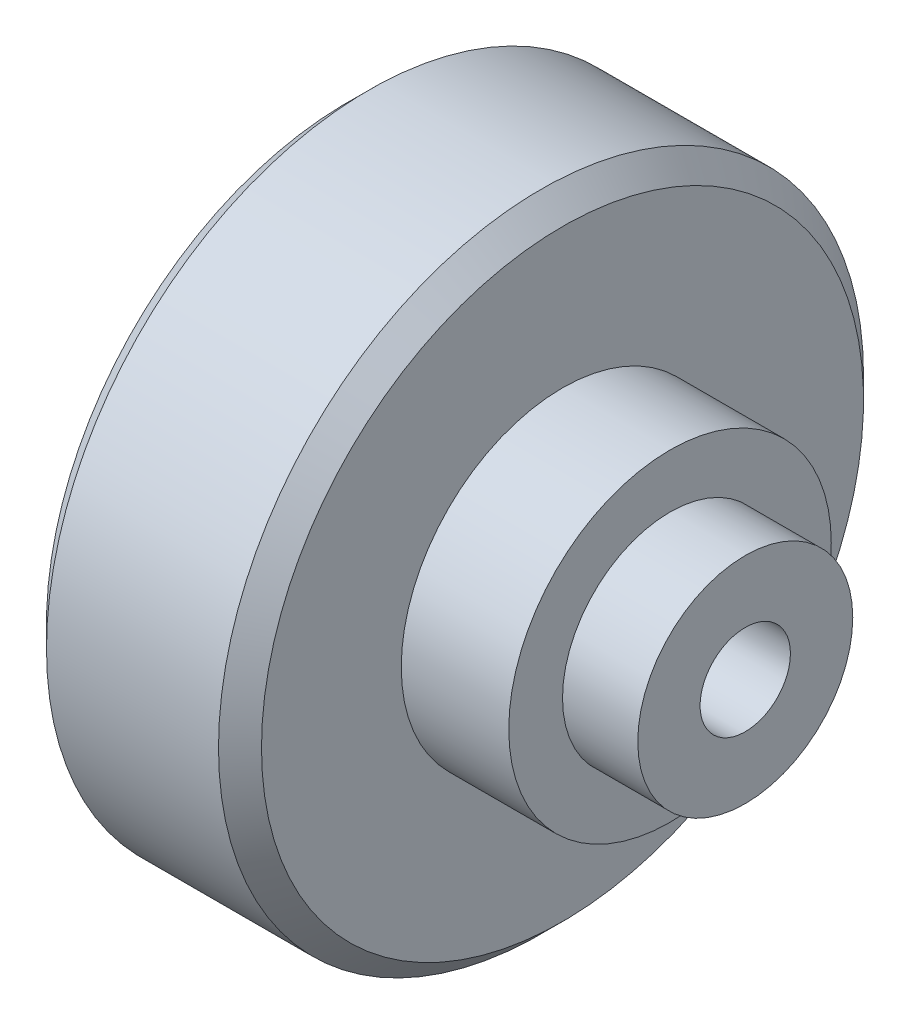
ISO-10303-21;
HEADER;
FILE_DESCRIPTION(('STEP AP214'),'2;1');
FILE_NAME('part.step','',(''),(''),'','','');
FILE_SCHEMA(('AUTOMOTIVE_DESIGN { 1 0 10303 214 1 1 1 1 }'));
ENDSEC;
DATA;
#1=APPLICATION_CONTEXT('core data for automotive mechanical design processes');
#2=APPLICATION_PROTOCOL_DEFINITION('international standard','automotive_design',2000,#1);
#3=PRODUCT_CONTEXT('',#1,'mechanical');
#4=PRODUCT('Part','Part','',(#3));
#5=PRODUCT_RELATED_PRODUCT_CATEGORY('part','',(#4));
#6=PRODUCT_DEFINITION_FORMATION('','',#4);
#7=PRODUCT_DEFINITION_CONTEXT('part definition',#1,'design');
#8=PRODUCT_DEFINITION('design','',#6,#7);
#9=PRODUCT_DEFINITION_SHAPE('','',#8);
#10=(LENGTH_UNIT() NAMED_UNIT(*) SI_UNIT(.MILLI.,.METRE.));
#11=(NAMED_UNIT(*) PLANE_ANGLE_UNIT() SI_UNIT($,.RADIAN.));
#12=(NAMED_UNIT(*) SI_UNIT($,.STERADIAN.) SOLID_ANGLE_UNIT());
#13=UNCERTAINTY_MEASURE_WITH_UNIT(LENGTH_MEASURE(1.E-05),#10,'distance_accuracy_value','');
#14=(GEOMETRIC_REPRESENTATION_CONTEXT(3) GLOBAL_UNCERTAINTY_ASSIGNED_CONTEXT((#13)) GLOBAL_UNIT_ASSIGNED_CONTEXT((#10,
#11,#12)) REPRESENTATION_CONTEXT('',''));
#15=CARTESIAN_POINT('',(0.,0.,0.));
#16=DIRECTION('',(0.,0.,1.));
#17=DIRECTION('',(1.,0.,0.));
#18=AXIS2_PLACEMENT_3D('',#15,#16,#17);
#19=CARTESIAN_POINT('',(0.,0.,-15.));
#20=DIRECTION('',(1.,0.,0.));
#21=DIRECTION('',(0.,0.,-1.));
#22=AXIS2_PLACEMENT_3D('',#19,#20,#21);
#23=PLANE('',#22);
#24=CARTESIAN_POINT('',(0.,0.,0.));
#25=DIRECTION('',(1.,0.,0.));
#26=DIRECTION('',(0.,0.,-1.));
#27=AXIS2_PLACEMENT_3D('',#24,#25,#26);
#28=CIRCLE('',#27,2.1);
#29=CARTESIAN_POINT('',(0.,0.,-2.1));
#30=VERTEX_POINT('',#29);
#31=EDGE_CURVE('E61',#30,#30,#28,.T.);
#32=ORIENTED_EDGE('',*,*,#31,.T.);
#33=EDGE_LOOP('',(#32));
#34=FACE_BOUND('',#33,.T.);
#35=CARTESIAN_POINT('',(0.,0.,0.));
#36=DIRECTION('',(1.,0.,0.));
#37=DIRECTION('',(0.,0.,-1.));
#38=AXIS2_PLACEMENT_3D('',#35,#36,#37);
#39=CIRCLE('',#38,14.);
#40=CARTESIAN_POINT('',(0.,0.,-14.));
#41=VERTEX_POINT('',#40);
#42=EDGE_CURVE('E44',#41,#41,#39,.F.);
#43=ORIENTED_EDGE('',*,*,#42,.T.);
#44=EDGE_LOOP('',(#43));
#45=FACE_BOUND('',#44,.T.);
#46=ADVANCED_FACE('F29',(#34,#45),#23,.F.);
#47=CARTESIAN_POINT('',(0.,0.,0.));
#48=DIRECTION('',(-1.,0.,0.));
#49=DIRECTION('',(0.,0.,1.));
#50=AXIS2_PLACEMENT_3D('',#47,#48,#49);
#51=CYLINDRICAL_SURFACE('',#50,15.);
#52=CARTESIAN_POINT('',(1.00000000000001,0.,0.));
#53=DIRECTION('',(1.,0.,0.));
#54=DIRECTION('',(0.,0.,-1.));
#55=AXIS2_PLACEMENT_3D('',#52,#53,#54);
#56=CIRCLE('',#55,15.);
#57=CARTESIAN_POINT('',(1.00000000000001,0.,-15.));
#58=VERTEX_POINT('',#57);
#59=EDGE_CURVE('E36',#58,#58,#56,.T.);
#60=ORIENTED_EDGE('',*,*,#59,.T.);
#61=EDGE_LOOP('',(#60));
#62=FACE_BOUND('',#61,.T.);
#63=CARTESIAN_POINT('',(8.99999999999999,0.,0.));
#64=DIRECTION('',(-1.,0.,0.));
#65=DIRECTION('',(0.,0.,1.));
#66=AXIS2_PLACEMENT_3D('',#63,#64,#65);
#67=CIRCLE('',#66,15.);
#68=CARTESIAN_POINT('',(8.99999999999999,0.,15.));
#69=VERTEX_POINT('',#68);
#70=EDGE_CURVE('E40',#69,#69,#67,.T.);
#71=ORIENTED_EDGE('',*,*,#70,.T.);
#72=EDGE_LOOP('',(#71));
#73=FACE_BOUND('',#72,.T.);
#74=ADVANCED_FACE('F90',(#62,#73),#51,.T.);
#75=CARTESIAN_POINT('',(9.99999999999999,0.,-7.49999999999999));
#76=DIRECTION('',(-1.,0.,0.));
#77=DIRECTION('',(0.,0.,1.));
#78=AXIS2_PLACEMENT_3D('',#75,#76,#77);
#79=PLANE('',#78);
#80=CARTESIAN_POINT('',(9.99999999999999,0.,0.));
#81=DIRECTION('',(-1.,0.,0.));
#82=DIRECTION('',(0.,0.,1.));
#83=AXIS2_PLACEMENT_3D('',#80,#81,#82);
#84=CIRCLE('',#83,14.);
#85=CARTESIAN_POINT('',(9.99999999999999,0.,14.));
#86=VERTEX_POINT('',#85);
#87=EDGE_CURVE('E10',#86,#86,#84,.F.);
#88=ORIENTED_EDGE('',*,*,#87,.T.);
#89=EDGE_LOOP('',(#88));
#90=FACE_BOUND('',#89,.T.);
#91=CARTESIAN_POINT('',(9.99999999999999,0.,0.));
#92=DIRECTION('',(-1.,0.,0.));
#93=DIRECTION('',(0.,0.,1.));
#94=AXIS2_PLACEMENT_3D('',#91,#92,#93);
#95=CIRCLE('',#94,7.49999999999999);
#96=CARTESIAN_POINT('',(9.99999999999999,0.,7.49999999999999));
#97=VERTEX_POINT('',#96);
#98=EDGE_CURVE('E49',#97,#97,#95,.T.);
#99=ORIENTED_EDGE('',*,*,#98,.T.);
#100=EDGE_LOOP('',(#99));
#101=FACE_BOUND('',#100,.T.);
#102=ADVANCED_FACE('F96',(#90,#101),#79,.F.);
#103=CARTESIAN_POINT('',(0.,0.,0.));
#104=DIRECTION('',(-1.,0.,0.));
#105=DIRECTION('',(0.,0.,1.));
#106=AXIS2_PLACEMENT_3D('',#103,#104,#105);
#107=CYLINDRICAL_SURFACE('',#106,7.49999999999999);
#108=ORIENTED_EDGE('',*,*,#98,.F.);
#109=EDGE_LOOP('',(#108));
#110=FACE_BOUND('',#109,.T.);
#111=CARTESIAN_POINT('',(15.,0.,0.));
#112=DIRECTION('',(-1.,0.,0.));
#113=DIRECTION('',(0.,0.,1.));
#114=AXIS2_PLACEMENT_3D('',#111,#112,#113);
#115=CIRCLE('',#114,7.49999999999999);
#116=CARTESIAN_POINT('',(15.,0.,7.49999999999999));
#117=VERTEX_POINT('',#116);
#118=EDGE_CURVE('E52',#117,#117,#115,.T.);
#119=ORIENTED_EDGE('',*,*,#118,.T.);
#120=EDGE_LOOP('',(#119));
#121=FACE_BOUND('',#120,.T.);
#122=ADVANCED_FACE('F85',(#110,#121),#107,.T.);
#123=CARTESIAN_POINT('',(15.,0.,-4.99999999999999));
#124=DIRECTION('',(-1.,0.,0.));
#125=DIRECTION('',(0.,0.,1.));
#126=AXIS2_PLACEMENT_3D('',#123,#124,#125);
#127=PLANE('',#126);
#128=ORIENTED_EDGE('',*,*,#118,.F.);
#129=EDGE_LOOP('',(#128));
#130=FACE_BOUND('',#129,.T.);
#131=CARTESIAN_POINT('',(15.,0.,0.));
#132=DIRECTION('',(-1.,0.,0.));
#133=DIRECTION('',(0.,0.,1.));
#134=AXIS2_PLACEMENT_3D('',#131,#132,#133);
#135=CIRCLE('',#134,4.99999999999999);
#136=CARTESIAN_POINT('',(15.,0.,4.99999999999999));
#137=VERTEX_POINT('',#136);
#138=EDGE_CURVE('E55',#137,#137,#135,.T.);
#139=ORIENTED_EDGE('',*,*,#138,.T.);
#140=EDGE_LOOP('',(#139));
#141=FACE_BOUND('',#140,.T.);
#142=ADVANCED_FACE('F79',(#130,#141),#127,.F.);
#143=CARTESIAN_POINT('',(0.,0.,0.));
#144=DIRECTION('',(-1.,0.,0.));
#145=DIRECTION('',(0.,0.,1.));
#146=AXIS2_PLACEMENT_3D('',#143,#144,#145);
#147=CYLINDRICAL_SURFACE('',#146,4.99999999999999);
#148=ORIENTED_EDGE('',*,*,#138,.F.);
#149=EDGE_LOOP('',(#148));
#150=FACE_BOUND('',#149,.T.);
#151=CARTESIAN_POINT('',(18.5,0.,0.));
#152=DIRECTION('',(-1.,0.,0.));
#153=DIRECTION('',(0.,0.,1.));
#154=AXIS2_PLACEMENT_3D('',#151,#152,#153);
#155=CIRCLE('',#154,4.99999999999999);
#156=CARTESIAN_POINT('',(18.5,0.,4.99999999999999));
#157=VERTEX_POINT('',#156);
#158=EDGE_CURVE('E58',#157,#157,#155,.T.);
#159=ORIENTED_EDGE('',*,*,#158,.T.);
#160=EDGE_LOOP('',(#159));
#161=FACE_BOUND('',#160,.T.);
#162=ADVANCED_FACE('F74',(#150,#161),#147,.T.);
#163=CARTESIAN_POINT('',(18.5,0.,0.));
#164=DIRECTION('',(-1.,0.,0.));
#165=DIRECTION('',(0.,0.,1.));
#166=AXIS2_PLACEMENT_3D('',#163,#164,#165);
#167=PLANE('',#166);
#168=CARTESIAN_POINT('',(18.5,0.,0.));
#169=DIRECTION('',(1.,0.,0.));
#170=DIRECTION('',(0.,0.,-1.));
#171=AXIS2_PLACEMENT_3D('',#168,#169,#170);
#172=CIRCLE('',#171,2.09999999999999);
#173=CARTESIAN_POINT('',(18.5,0.,-2.09999999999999));
#174=VERTEX_POINT('',#173);
#175=EDGE_CURVE('E64',#174,#174,#172,.T.);
#176=ORIENTED_EDGE('',*,*,#175,.F.);
#177=EDGE_LOOP('',(#176));
#178=FACE_BOUND('',#177,.T.);
#179=ORIENTED_EDGE('',*,*,#158,.F.);
#180=EDGE_LOOP('',(#179));
#181=FACE_BOUND('',#180,.T.);
#182=ADVANCED_FACE('F70',(#178,#181),#167,.F.);
#183=CARTESIAN_POINT('',(0.,0.,0.));
#184=DIRECTION('',(1.,0.,0.));
#185=DIRECTION('',(0.,0.,-1.));
#186=AXIS2_PLACEMENT_3D('',#183,#184,#185);
#187=CONICAL_SURFACE('',#186,14.,0.785398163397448);
#188=ORIENTED_EDGE('',*,*,#59,.F.);
#189=EDGE_LOOP('',(#188));
#190=FACE_BOUND('',#189,.T.);
#191=ORIENTED_EDGE('',*,*,#42,.F.);
#192=EDGE_LOOP('',(#191));
#193=FACE_BOUND('',#192,.T.);
#194=ADVANCED_FACE('F73',(#190,#193),#187,.T.);
#195=CARTESIAN_POINT('',(8.99999999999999,0.,0.));
#196=DIRECTION('',(-1.,0.,0.));
#197=DIRECTION('',(0.,0.,1.));
#198=AXIS2_PLACEMENT_3D('',#195,#196,#197);
#199=CONICAL_SURFACE('',#198,15.,0.785398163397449);
#200=ORIENTED_EDGE('',*,*,#87,.F.);
#201=EDGE_LOOP('',(#200));
#202=FACE_BOUND('',#201,.T.);
#203=ORIENTED_EDGE('',*,*,#70,.F.);
#204=EDGE_LOOP('',(#203));
#205=FACE_BOUND('',#204,.T.);
#206=ADVANCED_FACE('F31',(#202,#205),#199,.T.);
#207=CARTESIAN_POINT('',(18.5,0.,0.));
#208=DIRECTION('',(1.,0.,0.));
#209=DIRECTION('',(0.,0.,-1.));
#210=AXIS2_PLACEMENT_3D('',#207,#208,#209);
#211=CYLINDRICAL_SURFACE('',#210,2.09999999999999);
#212=ORIENTED_EDGE('',*,*,#31,.F.);
#213=EDGE_LOOP('',(#212));
#214=FACE_BOUND('',#213,.T.);
#215=ORIENTED_EDGE('',*,*,#175,.T.);
#216=EDGE_LOOP('',(#215));
#217=FACE_BOUND('',#216,.T.);
#218=ADVANCED_FACE('F68',(#214,#217),#211,.F.);
#219=CLOSED_SHELL('',(#46,#74,#102,#122,#142,#162,#182,#194,#206,#218));
#220=MANIFOLD_SOLID_BREP('B2',#219);
#221=ADVANCED_BREP_SHAPE_REPRESENTATION('',(#18,#220),#14);
#222=SHAPE_DEFINITION_REPRESENTATION(#9,#221);
ENDSEC;
END-ISO-10303-21;
